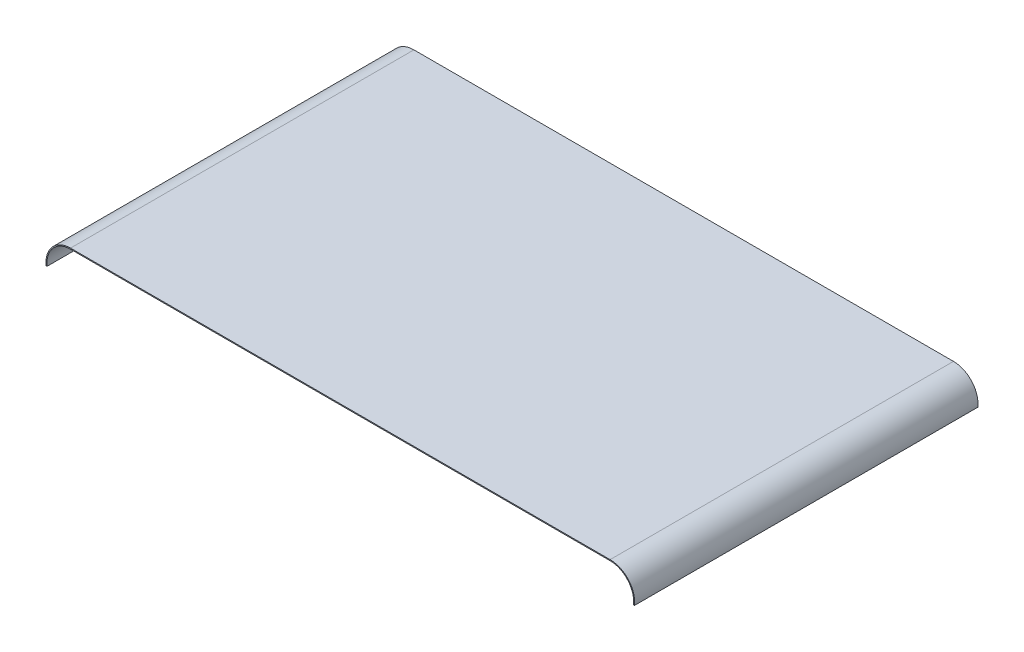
from build123d import *

# Parameters (mm, degrees)
SURFACE_EXTRUDE1_1_BACK  = 700
SURFACE_EXTRUDE1_1_DEPTH = 700
THICKEN1_T1              = 2


with BuildPart() as body_1:
    # Surface-Extrude1: a surface, the sketch's curves swept straight by 700 mm
    with BuildLine(Plane.XY.offset(-SURFACE_EXTRUDE1_1_BACK), mode=Mode.PRIVATE) as surface_extrude1_1_path:
        ThreePointArc((1109.615561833, -56.188378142), (1097.479453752, -16.904825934), (1060, 0))
        Line((1060, 0), (-40, 0))
        ThreePointArc((-40, 0), (-77.479453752, -16.904825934), (-89.615561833, -56.188378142))
    surface_extrude1_1 = Shell.extrude(surface_extrude1_1_path.wire(), (0 * SURFACE_EXTRUDE1_1_DEPTH, 0 * SURFACE_EXTRUDE1_1_DEPTH, 1 * SURFACE_EXTRUDE1_1_DEPTH))
    add(Solid.thicken(surface_extrude1_1, THICKEN1_T1))


solid = body_1.part
